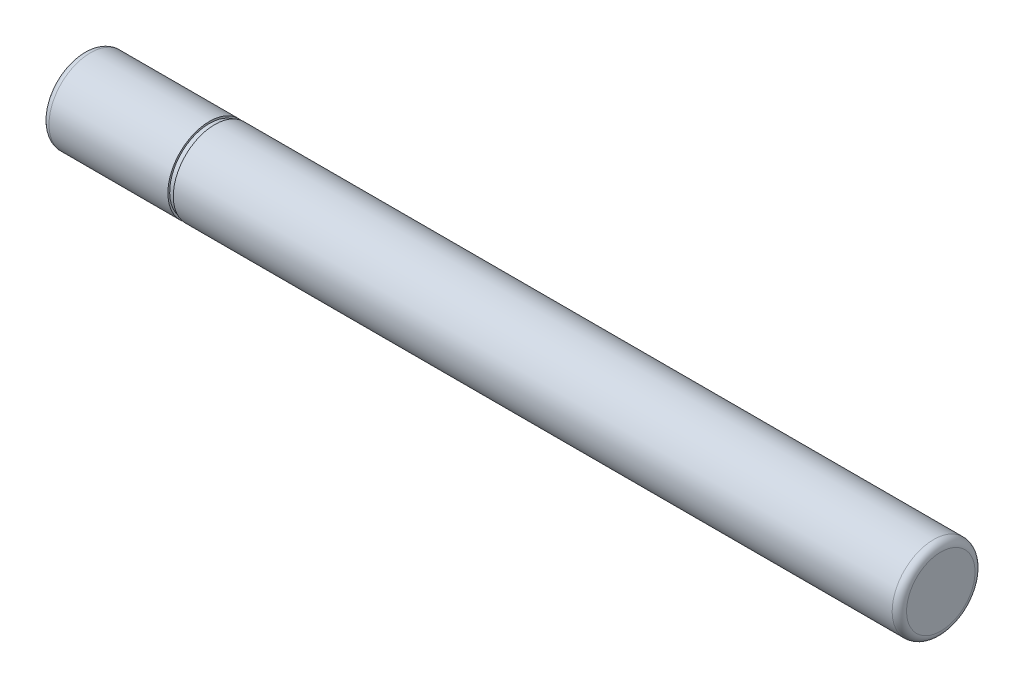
from build123d import *

# Parameters (mm, degrees)
CONG_1_R                = 2
ENL_V_START             = 500
ESQUISSE2_R             = 8
ENL_V_MAT_EXTRU_1_DEPTH = 500


with BuildPart() as part:
    # Esquisse1 → R_volution1 (revolve)
    with BuildSketch(Plane.XY):
        Polygon((0, 0), (-201, 0), (-201, 5), (0, 5), (0, 8), (-1, 8), (-1, 11.5), (34, 11.5), (34, 11), (35.5, 11), (35.5, 11.5), (237, 11.5), (237, 0), align=None)
    revolve(axis=Axis((0, 0, 0), (-1, 0, 0)))

    # Cong_1
    cong_1_edges = [part.edges().sort_by_distance(p)[0] for p in [
        (-1, -11.5, 0),
        (237, -11.5, 0),
    ]]
    fillet(cong_1_edges, radius=CONG_1_R)

    # Esquisse2 → Enl_v. mat.-Extru.1 (cut)
    with BuildSketch(Plane.ZY.offset(ENL_V_START)):
        with Locations(Location((0, 0, 0), (0, 0, 90))):
            Circle(ESQUISSE2_R)
    extrude(amount=-ENL_V_MAT_EXTRU_1_DEPTH, mode=Mode.SUBTRACT)


solid = part.part
